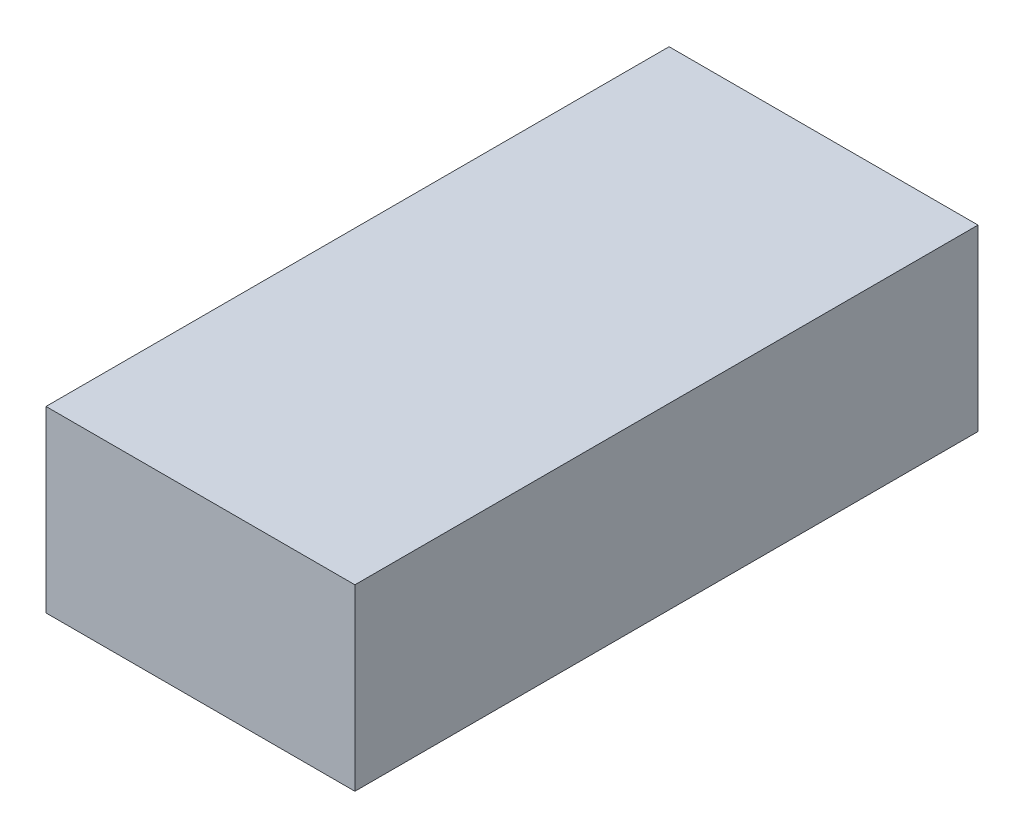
ISO-10303-21;
HEADER;
FILE_DESCRIPTION(('STEP AP214'),'2;1');
FILE_NAME('part.step','',(''),(''),'','','');
FILE_SCHEMA(('AUTOMOTIVE_DESIGN { 1 0 10303 214 1 1 1 1 }'));
ENDSEC;
DATA;
#1=APPLICATION_CONTEXT('core data for automotive mechanical design processes');
#2=APPLICATION_PROTOCOL_DEFINITION('international standard','automotive_design',2000,#1);
#3=PRODUCT_CONTEXT('',#1,'mechanical');
#4=PRODUCT('Part','Part','',(#3));
#5=PRODUCT_RELATED_PRODUCT_CATEGORY('part','',(#4));
#6=PRODUCT_DEFINITION_FORMATION('','',#4);
#7=PRODUCT_DEFINITION_CONTEXT('part definition',#1,'design');
#8=PRODUCT_DEFINITION('design','',#6,#7);
#9=PRODUCT_DEFINITION_SHAPE('','',#8);
#10=(LENGTH_UNIT() NAMED_UNIT(*) SI_UNIT(.MILLI.,.METRE.));
#11=(NAMED_UNIT(*) PLANE_ANGLE_UNIT() SI_UNIT($,.RADIAN.));
#12=(NAMED_UNIT(*) SI_UNIT($,.STERADIAN.) SOLID_ANGLE_UNIT());
#13=UNCERTAINTY_MEASURE_WITH_UNIT(LENGTH_MEASURE(1.E-05),#10,'distance_accuracy_value','');
#14=(GEOMETRIC_REPRESENTATION_CONTEXT(3) GLOBAL_UNCERTAINTY_ASSIGNED_CONTEXT((#13)) GLOBAL_UNIT_ASSIGNED_CONTEXT((#10,
#11,#12)) REPRESENTATION_CONTEXT('',''));
#15=CARTESIAN_POINT('',(0.,0.,0.));
#16=DIRECTION('',(0.,0.,1.));
#17=DIRECTION('',(1.,0.,0.));
#18=AXIS2_PLACEMENT_3D('',#15,#16,#17);
#19=CARTESIAN_POINT('',(0.,0.,766.5));
#20=DIRECTION('',(0.,0.,1.));
#21=DIRECTION('',(1.,0.,0.));
#22=AXIS2_PLACEMENT_3D('',#19,#20,#21);
#23=PLANE('',#22);
#24=DIRECTION('',(1.,0.,0.));
#25=VECTOR('',#24,1.);
#26=CARTESIAN_POINT('',(-190.,-110.,766.5));
#27=LINE('',#26,#25);
#28=CARTESIAN_POINT('',(-190.,-110.,766.5));
#29=VERTEX_POINT('',#28);
#30=CARTESIAN_POINT('',(190.,-110.,766.5));
#31=VERTEX_POINT('',#30);
#32=EDGE_CURVE('E80',#29,#31,#27,.T.);
#33=ORIENTED_EDGE('',*,*,#32,.T.);
#34=DIRECTION('',(0.,1.,0.));
#35=VECTOR('',#34,1.);
#36=CARTESIAN_POINT('',(190.,-110.,766.5));
#37=LINE('',#36,#35);
#38=CARTESIAN_POINT('',(190.,110.,766.5));
#39=VERTEX_POINT('',#38);
#40=EDGE_CURVE('E102',#31,#39,#37,.T.);
#41=ORIENTED_EDGE('',*,*,#40,.T.);
#42=DIRECTION('',(-1.,0.,0.));
#43=VECTOR('',#42,1.);
#44=CARTESIAN_POINT('',(190.,110.,766.5));
#45=LINE('',#44,#43);
#46=CARTESIAN_POINT('',(-190.,110.,766.5));
#47=VERTEX_POINT('',#46);
#48=EDGE_CURVE('E73',#39,#47,#45,.T.);
#49=ORIENTED_EDGE('',*,*,#48,.T.);
#50=DIRECTION('',(0.,-1.,0.));
#51=VECTOR('',#50,1.);
#52=CARTESIAN_POINT('',(-190.,110.,766.5));
#53=LINE('',#52,#51);
#54=EDGE_CURVE('E10',#47,#29,#53,.T.);
#55=ORIENTED_EDGE('',*,*,#54,.T.);
#56=EDGE_LOOP('',(#33,#41,#49,#55));
#57=FACE_BOUND('',#56,.T.);
#58=ADVANCED_FACE('F16',(#57),#23,.T.);
#59=CARTESIAN_POINT('',(0.,0.,0.));
#60=DIRECTION('',(0.,0.,1.));
#61=DIRECTION('',(1.,0.,0.));
#62=AXIS2_PLACEMENT_3D('',#59,#60,#61);
#63=PLANE('',#62);
#64=DIRECTION('',(0.,-1.,0.));
#65=VECTOR('',#64,1.);
#66=CARTESIAN_POINT('',(-190.,110.,0.));
#67=LINE('',#66,#65);
#68=CARTESIAN_POINT('',(-190.,110.,0.));
#69=VERTEX_POINT('',#68);
#70=CARTESIAN_POINT('',(-190.,-110.,0.));
#71=VERTEX_POINT('',#70);
#72=EDGE_CURVE('E19',#69,#71,#67,.T.);
#73=ORIENTED_EDGE('',*,*,#72,.F.);
#74=DIRECTION('',(-1.,0.,0.));
#75=VECTOR('',#74,1.);
#76=CARTESIAN_POINT('',(190.,110.,0.));
#77=LINE('',#76,#75);
#78=CARTESIAN_POINT('',(190.,110.,0.));
#79=VERTEX_POINT('',#78);
#80=EDGE_CURVE('E106',#79,#69,#77,.T.);
#81=ORIENTED_EDGE('',*,*,#80,.F.);
#82=DIRECTION('',(0.,1.,0.));
#83=VECTOR('',#82,1.);
#84=CARTESIAN_POINT('',(190.,-110.,0.));
#85=LINE('',#84,#83);
#86=CARTESIAN_POINT('',(190.,-110.,0.));
#87=VERTEX_POINT('',#86);
#88=EDGE_CURVE('E82',#87,#79,#85,.T.);
#89=ORIENTED_EDGE('',*,*,#88,.F.);
#90=DIRECTION('',(1.,0.,0.));
#91=VECTOR('',#90,1.);
#92=CARTESIAN_POINT('',(-190.,-110.,0.));
#93=LINE('',#92,#91);
#94=EDGE_CURVE('E78',#71,#87,#93,.T.);
#95=ORIENTED_EDGE('',*,*,#94,.F.);
#96=EDGE_LOOP('',(#73,#81,#89,#95));
#97=FACE_BOUND('',#96,.T.);
#98=ADVANCED_FACE('F84',(#97),#63,.F.);
#99=CARTESIAN_POINT('',(-190.,110.,0.));
#100=DIRECTION('',(1.,0.,0.));
#101=DIRECTION('',(0.,1.,0.));
#102=AXIS2_PLACEMENT_3D('',#99,#100,#101);
#103=PLANE('',#102);
#104=ORIENTED_EDGE('',*,*,#72,.T.);
#105=DIRECTION('',(0.,0.,1.));
#106=VECTOR('',#105,1.);
#107=CARTESIAN_POINT('',(-190.,-110.,0.));
#108=LINE('',#107,#106);
#109=EDGE_CURVE('E67',#71,#29,#108,.T.);
#110=ORIENTED_EDGE('',*,*,#109,.T.);
#111=ORIENTED_EDGE('',*,*,#54,.F.);
#112=DIRECTION('',(0.,0.,1.));
#113=VECTOR('',#112,1.);
#114=CARTESIAN_POINT('',(-190.,110.,0.));
#115=LINE('',#114,#113);
#116=EDGE_CURVE('E70',#69,#47,#115,.T.);
#117=ORIENTED_EDGE('',*,*,#116,.F.);
#118=EDGE_LOOP('',(#104,#110,#111,#117));
#119=FACE_BOUND('',#118,.T.);
#120=ADVANCED_FACE('F66',(#119),#103,.F.);
#121=CARTESIAN_POINT('',(190.,110.,0.));
#122=DIRECTION('',(0.,-1.,0.));
#123=DIRECTION('',(0.,0.,-1.));
#124=AXIS2_PLACEMENT_3D('',#121,#122,#123);
#125=PLANE('',#124);
#126=ORIENTED_EDGE('',*,*,#80,.T.);
#127=ORIENTED_EDGE('',*,*,#116,.T.);
#128=ORIENTED_EDGE('',*,*,#48,.F.);
#129=DIRECTION('',(0.,0.,1.));
#130=VECTOR('',#129,1.);
#131=CARTESIAN_POINT('',(190.,110.,0.));
#132=LINE('',#131,#130);
#133=EDGE_CURVE('E98',#79,#39,#132,.T.);
#134=ORIENTED_EDGE('',*,*,#133,.F.);
#135=EDGE_LOOP('',(#126,#127,#128,#134));
#136=FACE_BOUND('',#135,.T.);
#137=ADVANCED_FACE('F116',(#136),#125,.F.);
#138=CARTESIAN_POINT('',(190.,-110.,0.));
#139=DIRECTION('',(-1.,0.,0.));
#140=DIRECTION('',(0.,0.,1.));
#141=AXIS2_PLACEMENT_3D('',#138,#139,#140);
#142=PLANE('',#141);
#143=ORIENTED_EDGE('',*,*,#88,.T.);
#144=ORIENTED_EDGE('',*,*,#133,.T.);
#145=ORIENTED_EDGE('',*,*,#40,.F.);
#146=DIRECTION('',(0.,0.,1.));
#147=VECTOR('',#146,1.);
#148=CARTESIAN_POINT('',(190.,-110.,0.));
#149=LINE('',#148,#147);
#150=EDGE_CURVE('E88',#87,#31,#149,.T.);
#151=ORIENTED_EDGE('',*,*,#150,.F.);
#152=EDGE_LOOP('',(#143,#144,#145,#151));
#153=FACE_BOUND('',#152,.T.);
#154=ADVANCED_FACE('F118',(#153),#142,.F.);
#155=CARTESIAN_POINT('',(-190.,-110.,0.));
#156=DIRECTION('',(0.,1.,0.));
#157=DIRECTION('',(1.,0.,0.));
#158=AXIS2_PLACEMENT_3D('',#155,#156,#157);
#159=PLANE('',#158);
#160=ORIENTED_EDGE('',*,*,#94,.T.);
#161=ORIENTED_EDGE('',*,*,#150,.T.);
#162=ORIENTED_EDGE('',*,*,#32,.F.);
#163=ORIENTED_EDGE('',*,*,#109,.F.);
#164=EDGE_LOOP('',(#160,#161,#162,#163));
#165=FACE_BOUND('',#164,.T.);
#166=ADVANCED_FACE('F76',(#165),#159,.F.);
#167=CLOSED_SHELL('',(#58,#98,#120,#137,#154,#166));
#168=MANIFOLD_SOLID_BREP('B1',#167);
#169=ADVANCED_BREP_SHAPE_REPRESENTATION('',(#18,#168),#14);
#170=SHAPE_DEFINITION_REPRESENTATION(#9,#169);
ENDSEC;
END-ISO-10303-21;
